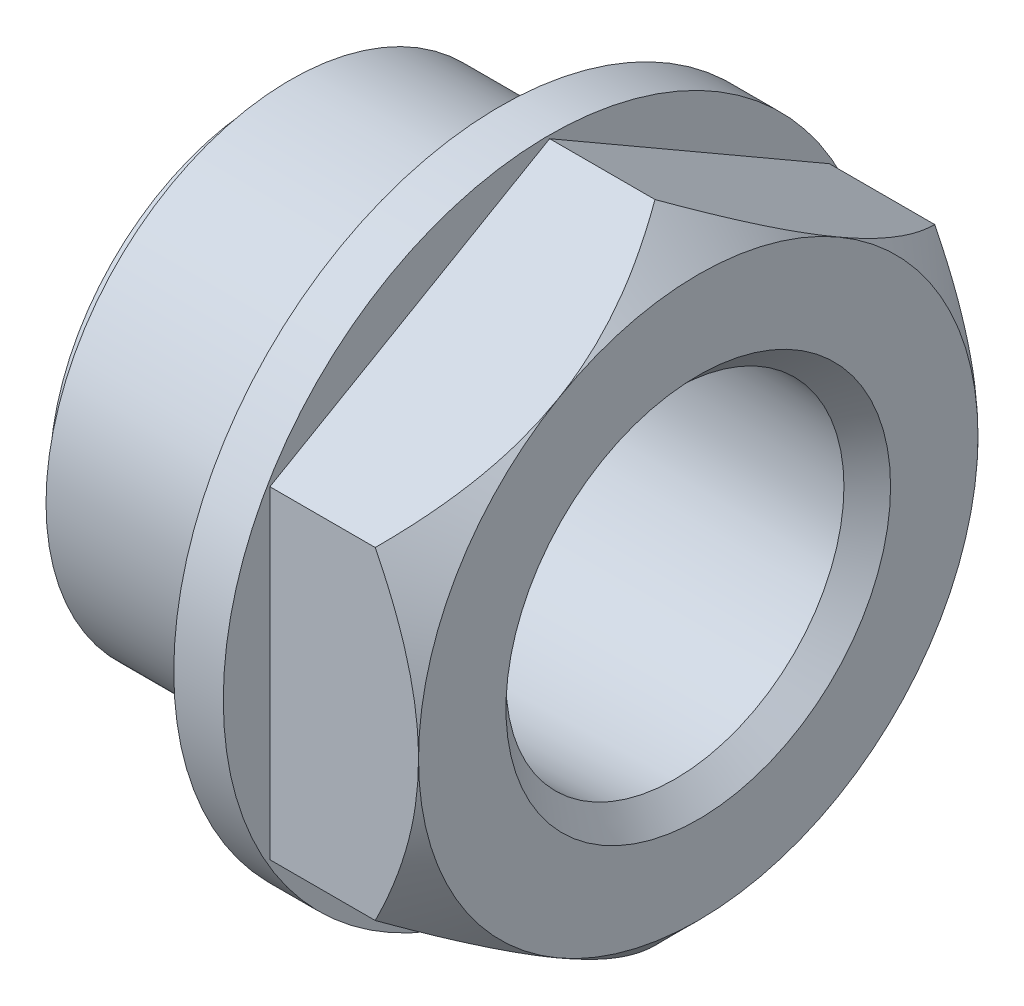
ISO-10303-21;
HEADER;
FILE_DESCRIPTION(('STEP AP214'),'2;1');
FILE_NAME('part.step','',(''),(''),'','','');
FILE_SCHEMA(('AUTOMOTIVE_DESIGN { 1 0 10303 214 1 1 1 1 }'));
ENDSEC;
DATA;
#1=APPLICATION_CONTEXT('core data for automotive mechanical design processes');
#2=APPLICATION_PROTOCOL_DEFINITION('international standard','automotive_design',2000,#1);
#3=PRODUCT_CONTEXT('',#1,'mechanical');
#4=PRODUCT('Part','Part','',(#3));
#5=PRODUCT_RELATED_PRODUCT_CATEGORY('part','',(#4));
#6=PRODUCT_DEFINITION_FORMATION('','',#4);
#7=PRODUCT_DEFINITION_CONTEXT('part definition',#1,'design');
#8=PRODUCT_DEFINITION('design','',#6,#7);
#9=PRODUCT_DEFINITION_SHAPE('','',#8);
#10=(LENGTH_UNIT() NAMED_UNIT(*) SI_UNIT(.MILLI.,.METRE.));
#11=(NAMED_UNIT(*) PLANE_ANGLE_UNIT() SI_UNIT($,.RADIAN.));
#12=(NAMED_UNIT(*) SI_UNIT($,.STERADIAN.) SOLID_ANGLE_UNIT());
#13=UNCERTAINTY_MEASURE_WITH_UNIT(LENGTH_MEASURE(1.E-05),#10,'distance_accuracy_value','');
#14=(GEOMETRIC_REPRESENTATION_CONTEXT(3) GLOBAL_UNCERTAINTY_ASSIGNED_CONTEXT((#13)) GLOBAL_UNIT_ASSIGNED_CONTEXT((#10,
#11,#12)) REPRESENTATION_CONTEXT('',''));
#15=CARTESIAN_POINT('',(0.,0.,0.));
#16=DIRECTION('',(0.,0.,1.));
#17=DIRECTION('',(1.,0.,0.));
#18=AXIS2_PLACEMENT_3D('',#15,#16,#17);
#19=CARTESIAN_POINT('',(10.,13.146,0.));
#20=DIRECTION('',(-1.,0.,0.));
#21=DIRECTION('',(0.,0.,1.));
#22=AXIS2_PLACEMENT_3D('',#19,#20,#21);
#23=PLANE('',#22);
#24=CARTESIAN_POINT('',(10.,0.,0.));
#25=DIRECTION('',(-1.,0.,0.));
#26=DIRECTION('',(0.,0.,1.));
#27=AXIS2_PLACEMENT_3D('',#24,#25,#26);
#28=CIRCLE('',#27,12.292);
#29=CARTESIAN_POINT('',(10.,0.,12.292));
#30=VERTEX_POINT('',#29);
#31=EDGE_CURVE('E366',#30,#30,#28,.T.);
#32=ORIENTED_EDGE('',*,*,#31,.F.);
#33=EDGE_LOOP('',(#32));
#34=FACE_BOUND('',#33,.T.);
#35=CARTESIAN_POINT('',(10.,0.,0.));
#36=DIRECTION('',(-1.,0.,0.));
#37=DIRECTION('',(0.,0.,1.));
#38=AXIS2_PLACEMENT_3D('',#35,#36,#37);
#39=CIRCLE('',#38,14.);
#40=CARTESIAN_POINT('',(10.,0.,14.));
#41=VERTEX_POINT('',#40);
#42=EDGE_CURVE('E19',#41,#41,#39,.F.);
#43=ORIENTED_EDGE('',*,*,#42,.F.);
#44=EDGE_LOOP('',(#43));
#45=FACE_BOUND('',#44,.T.);
#46=ADVANCED_FACE('F16',(#34,#45),#23,.T.);
#47=CARTESIAN_POINT('',(13.25,0.,0.));
#48=DIRECTION('',(-1.,0.,0.));
#49=DIRECTION('',(0.,0.,1.));
#50=AXIS2_PLACEMENT_3D('',#47,#48,#49);
#51=CYLINDRICAL_SURFACE('',#50,14.);
#52=CARTESIAN_POINT('',(12.125,0.,0.));
#53=DIRECTION('',(-1.,0.,0.));
#54=DIRECTION('',(0.,0.,1.));
#55=AXIS2_PLACEMENT_3D('',#52,#53,#54);
#56=CIRCLE('',#55,14.);
#57=CARTESIAN_POINT('',(12.125,0.,14.));
#58=VERTEX_POINT('',#57);
#59=EDGE_CURVE('E364',#58,#58,#56,.F.);
#60=ORIENTED_EDGE('',*,*,#59,.F.);
#61=EDGE_LOOP('',(#60));
#62=FACE_BOUND('',#61,.T.);
#63=ORIENTED_EDGE('',*,*,#42,.T.);
#64=EDGE_LOOP('',(#63));
#65=FACE_BOUND('',#64,.T.);
#66=ADVANCED_FACE('F306',(#62,#65),#51,.T.);
#67=CARTESIAN_POINT('',(9.5,0.,0.));
#68=DIRECTION('',(-1.,0.,0.));
#69=DIRECTION('',(0.,0.,1.));
#70=AXIS2_PLACEMENT_3D('',#67,#68,#69);
#71=CYLINDRICAL_SURFACE('',#70,12.292);
#72=ORIENTED_EDGE('',*,*,#31,.T.);
#73=EDGE_LOOP('',(#72));
#74=FACE_BOUND('',#73,.T.);
#75=CARTESIAN_POINT('',(9.,0.,0.));
#76=DIRECTION('',(-1.,0.,0.));
#77=DIRECTION('',(0.,0.,1.));
#78=AXIS2_PLACEMENT_3D('',#75,#76,#77);
#79=CIRCLE('',#78,12.292);
#80=CARTESIAN_POINT('',(9.,0.,12.292));
#81=VERTEX_POINT('',#80);
#82=EDGE_CURVE('E146',#81,#81,#79,.T.);
#83=ORIENTED_EDGE('',*,*,#82,.F.);
#84=EDGE_LOOP('',(#83));
#85=FACE_BOUND('',#84,.T.);
#86=ADVANCED_FACE('F304',(#74,#85),#71,.T.);
#87=CARTESIAN_POINT('',(12.125,0.,0.));
#88=DIRECTION('',(1.,0.,0.));
#89=DIRECTION('',(0.,0.,-1.));
#90=AXIS2_PLACEMENT_3D('',#87,#88,#89);
#91=PLANE('',#90);
#92=DIRECTION('',(0.,1.,0.));
#93=VECTOR('',#92,1.);
#94=CARTESIAN_POINT('',(12.125,-6.92820323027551,12.));
#95=LINE('',#94,#93);
#96=CARTESIAN_POINT('',(12.125,-6.92820323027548,12.));
#97=VERTEX_POINT('',#96);
#98=CARTESIAN_POINT('',(12.125,6.92820323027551,12.));
#99=VERTEX_POINT('',#98);
#100=EDGE_CURVE('E135',#97,#99,#95,.T.);
#101=ORIENTED_EDGE('',*,*,#100,.T.);
#102=DIRECTION('',(0.,0.5,-0.866025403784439));
#103=VECTOR('',#102,1.);
#104=CARTESIAN_POINT('',(12.125,6.92820323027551,12.));
#105=LINE('',#104,#103);
#106=CARTESIAN_POINT('',(12.125,13.856406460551,0.));
#107=VERTEX_POINT('',#106);
#108=EDGE_CURVE('E102',#99,#107,#105,.T.);
#109=ORIENTED_EDGE('',*,*,#108,.T.);
#110=DIRECTION('',(0.,-0.500000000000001,-0.866025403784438));
#111=VECTOR('',#110,1.);
#112=CARTESIAN_POINT('',(12.125,14.4337567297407,1.));
#113=LINE('',#112,#111);
#114=CARTESIAN_POINT('',(12.125,6.92820323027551,-12.));
#115=VERTEX_POINT('',#114);
#116=EDGE_CURVE('E96',#107,#115,#113,.T.);
#117=ORIENTED_EDGE('',*,*,#116,.T.);
#118=DIRECTION('',(0.,1.,0.));
#119=VECTOR('',#118,1.);
#120=CARTESIAN_POINT('',(12.125,6.9282032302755,-12.));
#121=LINE('',#120,#119);
#122=CARTESIAN_POINT('',(12.125,-6.9282032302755,-12.));
#123=VERTEX_POINT('',#122);
#124=EDGE_CURVE('E101',#115,#123,#121,.F.);
#125=ORIENTED_EDGE('',*,*,#124,.T.);
#126=DIRECTION('',(0.,-0.5,0.866025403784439));
#127=VECTOR('',#126,1.);
#128=CARTESIAN_POINT('',(12.125,-6.9282032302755,-12.));
#129=LINE('',#128,#127);
#130=CARTESIAN_POINT('',(12.125,-13.856406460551,0.));
#131=VERTEX_POINT('',#130);
#132=EDGE_CURVE('E125',#123,#131,#129,.T.);
#133=ORIENTED_EDGE('',*,*,#132,.T.);
#134=DIRECTION('',(0.,0.5,0.866025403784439));
#135=VECTOR('',#134,1.);
#136=CARTESIAN_POINT('',(12.125,-14.4337567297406,-1.));
#137=LINE('',#136,#135);
#138=EDGE_CURVE('E130',#131,#97,#137,.T.);
#139=ORIENTED_EDGE('',*,*,#138,.T.);
#140=EDGE_LOOP('',(#101,#109,#117,#125,#133,#139));
#141=FACE_BOUND('',#140,.T.);
#142=ORIENTED_EDGE('',*,*,#59,.T.);
#143=EDGE_LOOP('',(#142));
#144=FACE_BOUND('',#143,.T.);
#145=ADVANCED_FACE('F98',(#141,#144),#91,.T.);
#146=CARTESIAN_POINT('',(9.,11.386,0.));
#147=DIRECTION('',(-1.,0.,0.));
#148=DIRECTION('',(0.,0.,1.));
#149=AXIS2_PLACEMENT_3D('',#146,#147,#148);
#150=PLANE('',#149);
#151=CARTESIAN_POINT('',(9.,0.,0.));
#152=DIRECTION('',(-1.,0.,0.));
#153=DIRECTION('',(0.,0.,1.));
#154=AXIS2_PLACEMENT_3D('',#151,#152,#153);
#155=CIRCLE('',#154,10.48);
#156=CARTESIAN_POINT('',(9.,0.,10.48));
#157=VERTEX_POINT('',#156);
#158=EDGE_CURVE('E352',#157,#157,#155,.T.);
#159=ORIENTED_EDGE('',*,*,#158,.F.);
#160=EDGE_LOOP('',(#159));
#161=FACE_BOUND('',#160,.T.);
#162=ORIENTED_EDGE('',*,*,#82,.T.);
#163=EDGE_LOOP('',(#162));
#164=FACE_BOUND('',#163,.T.);
#165=ADVANCED_FACE('F296',(#161,#164),#150,.T.);
#166=CARTESIAN_POINT('',(24.875,6.92820323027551,12.));
#167=DIRECTION('',(0.,-0.866025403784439,-0.5));
#168=DIRECTION('',(0.,0.5,-0.866025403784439));
#169=AXIS2_PLACEMENT_3D('',#166,#167,#168);
#170=PLANE('',#169);
#171=ORIENTED_EDGE('',*,*,#108,.F.);
#172=DIRECTION('',(-1.,0.,0.));
#173=VECTOR('',#172,1.);
#174=CARTESIAN_POINT('',(24.875,6.92820323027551,12.));
#175=LINE('',#174,#173);
#176=CARTESIAN_POINT('',(16.6435935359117,6.92820322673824,12.0000000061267));
#177=VERTEX_POINT('',#176);
#178=EDGE_CURVE('E133',#99,#177,#175,.F.);
#179=ORIENTED_EDGE('',*,*,#178,.T.);
#180=CARTESIAN_POINT('',(18.5,10.3923048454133,5.99999999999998));
#181=CARTESIAN_POINT('',(18.5000214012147,10.3001580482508,6.15960293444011));
#182=CARTESIAN_POINT('',(18.4957550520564,10.2080149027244,6.31919954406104));
#183=CARTESIAN_POINT('',(18.4788058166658,10.0239363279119,6.63803298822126));
#184=CARTESIAN_POINT('',(18.4661242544,9.93200086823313,6.79726987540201));
#185=CARTESIAN_POINT('',(18.4325329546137,9.74866992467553,7.11480838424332));
#186=CARTESIAN_POINT('',(18.4116376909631,9.65727377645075,7.27311115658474));
#187=CARTESIAN_POINT('',(18.3619199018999,9.47502603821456,7.58877349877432));
#188=CARTESIAN_POINT('',(18.3330971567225,9.38417446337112,7.74613304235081));
#189=CARTESIAN_POINT('',(18.2362673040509,9.11539646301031,8.2116701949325));
#190=CARTESIAN_POINT('',(18.1573597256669,8.93843123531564,8.51818296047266));
#191=CARTESIAN_POINT('',(17.9736695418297,8.58789265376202,9.12533359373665));
#192=CARTESIAN_POINT('',(17.8688788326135,8.41432038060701,9.42596958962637));
#193=CARTESIAN_POINT('',(17.6773863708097,8.13044417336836,9.91765760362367));
#194=CARTESIAN_POINT('',(17.5969985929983,8.01905764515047,10.1105847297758));
#195=CARTESIAN_POINT('',(17.4278289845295,7.79791723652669,10.4936111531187));
#196=CARTESIAN_POINT('',(17.3390489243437,7.68816301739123,10.6837110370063));
#197=CARTESIAN_POINT('',(17.1530787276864,7.46911823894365,11.0631077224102));
#198=CARTESIAN_POINT('',(17.0558111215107,7.35984420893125,11.2523758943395));
#199=CARTESIAN_POINT('',(16.8545394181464,7.14286473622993,11.6281953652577));
#200=CARTESIAN_POINT('',(16.7505357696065,7.03515918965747,11.8147468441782));
#201=CARTESIAN_POINT('',(16.6435935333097,6.92820322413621,12.0000000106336));
#202=B_SPLINE_CURVE_WITH_KNOTS('',3,(#180,#181,#182,#183,#184,#185,#186,#187,#188,#189,#190,
#191,#192,#193,#194,#195,#196,#197,#198,#199,#200,#201),.UNSPECIFIED.,.F.,.F.,(4,2,2,2,2,2,2,2,
2,2,4),(0.,0.552819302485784,1.10555165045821,1.65731432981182,2.20909230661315,
3.29573306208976,4.38271446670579,5.09304904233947,5.80323409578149,6.52076262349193,
7.23824340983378),.UNSPECIFIED.);
#203=CARTESIAN_POINT('',(18.5,10.3923048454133,5.99999999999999));
#204=VERTEX_POINT('',#203);
#205=EDGE_CURVE('E255',#204,#177,#202,.T.);
#206=ORIENTED_EDGE('',*,*,#205,.F.);
#207=CARTESIAN_POINT('',(16.643593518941,13.8564064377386,-2.17519626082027E-08));
#208=CARTESIAN_POINT('',(16.7634443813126,13.7365345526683,0.207624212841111));
#209=CARTESIAN_POINT('',(16.8796150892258,13.6157176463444,0.416885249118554));
#210=CARTESIAN_POINT('',(17.1034212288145,13.3720429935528,0.838942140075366));
#211=CARTESIAN_POINT('',(17.2110517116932,13.2491841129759,1.0517399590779));
#212=CARTESIAN_POINT('',(17.4171049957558,13.0006364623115,1.48223711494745));
#213=CARTESIAN_POINT('',(17.5154658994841,12.8749347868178,1.6999588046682));
#214=CARTESIAN_POINT('',(17.7007499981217,12.6214559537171,2.13899702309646));
#215=CARTESIAN_POINT('',(17.7876752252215,12.4936791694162,2.36031290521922));
#216=CARTESIAN_POINT('',(17.9462537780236,12.239803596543,2.80003829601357));
#217=CARTESIAN_POINT('',(18.0182750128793,12.1137625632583,3.01834776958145));
#218=CARTESIAN_POINT('',(18.1486623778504,11.8599300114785,3.45799864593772));
#219=CARTESIAN_POINT('',(18.2070300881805,11.7321386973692,3.67933969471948));
#220=CARTESIAN_POINT('',(18.308634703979,11.4754170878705,4.1239945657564));
#221=CARTESIAN_POINT('',(18.3519126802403,11.3464908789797,4.34730130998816));
#222=CARTESIAN_POINT('',(18.4224240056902,11.0875704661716,4.79576462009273));
#223=CARTESIAN_POINT('',(18.4496624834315,10.9575766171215,5.02092057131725));
#224=CARTESIAN_POINT('',(18.4789525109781,10.75506120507,5.37168755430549));
#225=CARTESIAN_POINT('',(18.4868188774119,10.6827399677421,5.49695161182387));
#226=CARTESIAN_POINT('',(18.4973561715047,10.5377162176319,5.74814011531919));
#227=CARTESIAN_POINT('',(18.5000063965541,10.4650133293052,5.87406521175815));
#228=CARTESIAN_POINT('',(18.5,10.3923048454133,5.99999999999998));
#229=B_SPLINE_CURVE_WITH_KNOTS('',3,(#207,#208,#209,#210,#211,#212,#213,#214,#215,#216,#217,
#218,#219,#220,#221,#222,#223,#224,#225,#226,#227,#228),.UNSPECIFIED.,.F.,.F.,(4,2,2,2,2,2,2,2,
2,2,4),(0.,0.804132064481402,1.60872674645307,2.41836120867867,3.22785159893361,
4.01401465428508,4.80008667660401,5.58400217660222,6.36766688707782,6.8021509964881,
7.23835610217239),.UNSPECIFIED.);
#230=CARTESIAN_POINT('',(16.6435935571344,13.8564064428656,-3.06321939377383E-08));
#231=VERTEX_POINT('',#230);
#232=EDGE_CURVE('E282',#231,#204,#229,.T.);
#233=ORIENTED_EDGE('',*,*,#232,.F.);
#234=DIRECTION('',(1.,0.,0.));
#235=VECTOR('',#234,1.);
#236=CARTESIAN_POINT('',(24.875,13.856406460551,0.));
#237=LINE('',#236,#235);
#238=EDGE_CURVE('E106',#231,#107,#237,.F.);
#239=ORIENTED_EDGE('',*,*,#238,.T.);
#240=EDGE_LOOP('',(#171,#179,#206,#233,#239));
#241=FACE_BOUND('',#240,.T.);
#242=ADVANCED_FACE('F292',(#241),#170,.F.);
#243=CARTESIAN_POINT('',(24.875,-6.92820323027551,12.));
#244=DIRECTION('',(0.,0.,-1.));
#245=DIRECTION('',(-1.,0.,0.));
#246=AXIS2_PLACEMENT_3D('',#243,#244,#245);
#247=PLANE('',#246);
#248=CARTESIAN_POINT('',(16.6435935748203,6.9282031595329,12.));
#249=CARTESIAN_POINT('',(16.7634444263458,6.68845935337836,12.));
#250=CARTESIAN_POINT('',(16.8796151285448,6.44682552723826,12.));
#251=CARTESIAN_POINT('',(17.1034212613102,5.95947621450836,12.));
#252=CARTESIAN_POINT('',(17.2110517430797,5.7137584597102,12.));
#253=CARTESIAN_POINT('',(17.4171050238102,5.21666316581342,12.));
#254=CARTESIAN_POINT('',(17.5154659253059,4.96525981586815,12.));
#255=CARTESIAN_POINT('',(17.7007500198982,4.45830215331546,12.));
#256=CARTESIAN_POINT('',(17.7876752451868,4.20274858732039,12.));
#257=CARTESIAN_POINT('',(17.9462537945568,3.69499744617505,12.));
#258=CARTESIAN_POINT('',(18.0182750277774,3.44291538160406,12.));
#259=CARTESIAN_POINT('',(18.1486623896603,2.93525028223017,12.));
#260=CARTESIAN_POINT('',(18.207030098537,2.67966765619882,12.));
#261=CARTESIAN_POINT('',(18.3086347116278,2.16622444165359,12.));
#262=CARTESIAN_POINT('',(18.3519126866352,1.90837202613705,12.));
#263=CARTESIAN_POINT('',(18.4224240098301,1.39053120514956,12.));
#264=CARTESIAN_POINT('',(18.449662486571,1.13054350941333,12.));
#265=CARTESIAN_POINT('',(18.4789525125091,0.725512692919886,12.));
#266=CARTESIAN_POINT('',(18.4868188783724,0.580870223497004,12.));
#267=CARTESIAN_POINT('',(18.4973561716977,0.290822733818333,12.));
#268=CARTESIAN_POINT('',(18.5000063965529,0.145416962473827,12.));
#269=CARTESIAN_POINT('',(18.5,0.,12.));
#270=B_SPLINE_CURVE_WITH_KNOTS('',3,(#248,#249,#250,#251,#252,#253,#254,#255,#256,#257,#258,
#259,#260,#261,#262,#263,#264,#265,#266,#267,#268,#269),.UNSPECIFIED.,.F.,.F.,(4,2,2,2,2,2,2,2,
2,2,4),(0.,0.804132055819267,1.60872672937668,2.41836118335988,3.22785156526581,
4.01401461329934,4.80008662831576,5.58400212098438,6.36766682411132,6.80215091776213,
7.23835600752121),.UNSPECIFIED.);
#271=CARTESIAN_POINT('',(18.5,0.,12.));
#272=VERTEX_POINT('',#271);
#273=EDGE_CURVE('E277',#177,#272,#270,.T.);
#274=ORIENTED_EDGE('',*,*,#273,.F.);
#275=ORIENTED_EDGE('',*,*,#178,.F.);
#276=ORIENTED_EDGE('',*,*,#100,.F.);
#277=DIRECTION('',(1.,0.,0.));
#278=VECTOR('',#277,1.);
#279=CARTESIAN_POINT('',(24.875,-6.92820323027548,12.));
#280=LINE('',#279,#278);
#281=CARTESIAN_POINT('',(16.6435935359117,-6.92820323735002,12.));
#282=VERTEX_POINT('',#281);
#283=EDGE_CURVE('E128',#97,#282,#280,.T.);
#284=ORIENTED_EDGE('',*,*,#283,.T.);
#285=CARTESIAN_POINT('',(18.5,0.,12.));
#286=CARTESIAN_POINT('',(18.5000214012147,-0.184293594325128,12.));
#287=CARTESIAN_POINT('',(18.4957550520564,-0.368579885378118,12.));
#288=CARTESIAN_POINT('',(18.4788058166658,-0.736737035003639,12.));
#289=CARTESIAN_POINT('',(18.4661242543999,-0.920607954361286,12.));
#290=CARTESIAN_POINT('',(18.4325329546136,-1.28726984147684,12.));
#291=CARTESIAN_POINT('',(18.4116376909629,-1.47006213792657,12.));
#292=CARTESIAN_POINT('',(18.3619199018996,-1.83455761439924,12.));
#293=CARTESIAN_POINT('',(18.3330971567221,-2.01626076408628,12.));
#294=CARTESIAN_POINT('',(18.2362673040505,-2.55381676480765,12.));
#295=CARTESIAN_POINT('',(18.1573597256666,-2.9077472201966,12.));
#296=CARTESIAN_POINT('',(17.9736695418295,-3.60882438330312,12.));
#297=CARTESIAN_POINT('',(17.8688788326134,-3.95596892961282,12.));
#298=CARTESIAN_POINT('',(17.6773863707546,-4.52372134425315,12.));
#299=CARTESIAN_POINT('',(17.5969985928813,-4.74649440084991,12.));
#300=CARTESIAN_POINT('',(17.427828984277,-5.18877521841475,12.));
#301=CARTESIAN_POINT('',(17.3390489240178,-5.40828365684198,12.));
#302=CARTESIAN_POINT('',(17.1530787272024,-5.84637321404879,12.));
#303=CARTESIAN_POINT('',(17.0558111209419,-6.06492127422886,12.));
#304=CARTESIAN_POINT('',(16.8545394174,-6.49888021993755,12.));
#305=CARTESIAN_POINT('',(16.7505357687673,-6.71429131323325,12.));
#306=CARTESIAN_POINT('',(16.6435935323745,-6.92820324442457,12.));
#307=B_SPLINE_CURVE_WITH_KNOTS('',3,(#285,#286,#287,#288,#289,#290,#291,#292,#293,#294,#295,
#296,#297,#298,#299,#300,#301,#302,#303,#304,#305,#306),.UNSPECIFIED.,.F.,.F.,(4,2,2,2,2,2,2,2,
2,2,4),(0.,0.552819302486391,1.10555165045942,1.65731432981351,2.20909230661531,
3.29573306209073,4.3827144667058,5.09304904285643,5.80323409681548,6.52076262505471,
7.23824341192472),.UNSPECIFIED.);
#308=EDGE_CURVE('E254',#272,#282,#307,.T.);
#309=ORIENTED_EDGE('',*,*,#308,.F.);
#310=EDGE_LOOP('',(#274,#275,#276,#284,#309));
#311=FACE_BOUND('',#310,.T.);
#312=ADVANCED_FACE('F242',(#311),#247,.F.);
#313=CARTESIAN_POINT('',(24.875,-14.4337567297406,-1.));
#314=DIRECTION('',(0.,0.866025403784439,-0.5));
#315=DIRECTION('',(0.,0.5,0.866025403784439));
#316=AXIS2_PLACEMENT_3D('',#313,#314,#315);
#317=PLANE('',#316);
#318=CARTESIAN_POINT('',(18.5,-10.3923048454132,5.99999999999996));
#319=CARTESIAN_POINT('',(18.5000214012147,-10.4844516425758,5.84039706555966));
#320=CARTESIAN_POINT('',(18.4957550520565,-10.5765947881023,5.68080045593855));
#321=CARTESIAN_POINT('',(18.4788058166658,-10.7606733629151,5.36196701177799));
#322=CARTESIAN_POINT('',(18.4661242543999,-10.8526088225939,5.20273012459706));
#323=CARTESIAN_POINT('',(18.4325329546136,-11.0359397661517,4.88519161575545));
#324=CARTESIAN_POINT('',(18.411637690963,-11.1273359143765,4.72688884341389));
#325=CARTESIAN_POINT('',(18.3619199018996,-11.3095836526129,4.41122650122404));
#326=CARTESIAN_POINT('',(18.3330971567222,-11.4004352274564,4.25386695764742));
#327=CARTESIAN_POINT('',(18.2362673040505,-11.6692132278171,3.78832980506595));
#328=CARTESIAN_POINT('',(18.1573597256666,-11.8461784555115,3.48181703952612));
#329=CARTESIAN_POINT('',(17.9736695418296,-12.1967170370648,2.87466640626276));
#330=CARTESIAN_POINT('',(17.8688788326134,-12.3702893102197,2.57403041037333));
#331=CARTESIAN_POINT('',(17.6773863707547,-12.6541655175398,2.08234239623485));
#332=CARTESIAN_POINT('',(17.5969985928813,-12.7655520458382,1.88941526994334));
#333=CARTESIAN_POINT('',(17.4278289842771,-12.9866924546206,1.50638884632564));
#334=CARTESIAN_POINT('',(17.3390489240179,-13.0964466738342,1.31628896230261));
#335=CARTESIAN_POINT('',(17.1530787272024,-13.3154914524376,0.936892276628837));
#336=CARTESIAN_POINT('',(17.0558111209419,-13.4247654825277,0.747624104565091));
#337=CARTESIAN_POINT('',(16.8545394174,-13.641744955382,0.371804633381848));
#338=CARTESIAN_POINT('',(16.7505357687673,-13.7494505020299,0.185253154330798));
#339=CARTESIAN_POINT('',(16.6435935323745,-13.8564064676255,-1.22534716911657E-08));
#340=B_SPLINE_CURVE_WITH_KNOTS('',3,(#318,#319,#320,#321,#322,#323,#324,#325,#326,#327,#328,
#329,#330,#331,#332,#333,#334,#335,#336,#337,#338,#339),.UNSPECIFIED.,.F.,.F.,(4,2,2,2,2,2,2,2,
2,2,4),(0.,0.55281930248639,1.10555165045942,1.65731432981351,2.20909230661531,3.29573306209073,
4.38271446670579,5.09304904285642,5.80323409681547,6.52076262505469,7.23824341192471),.UNSPECIFIED.);
#341=CARTESIAN_POINT('',(18.5,-10.3923048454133,5.99999999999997));
#342=VERTEX_POINT('',#341);
#343=CARTESIAN_POINT('',(16.6435935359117,-13.8564064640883,-6.12673527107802E-09));
#344=VERTEX_POINT('',#343);
#345=EDGE_CURVE('E225',#342,#344,#340,.T.);
#346=ORIENTED_EDGE('',*,*,#345,.F.);
#347=CARTESIAN_POINT('',(16.6435935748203,-6.92820326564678,11.9999999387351));
#348=CARTESIAN_POINT('',(16.7634444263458,-7.04807516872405,11.7923757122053));
#349=CARTESIAN_POINT('',(16.8796151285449,-7.1688920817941,11.5831146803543));
#350=CARTESIAN_POINT('',(17.1034212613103,-7.41256673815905,11.1610577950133));
#351=CARTESIAN_POINT('',(17.2110517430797,-7.53542561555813,10.9482599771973));
#352=CARTESIAN_POINT('',(17.4171050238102,-7.78397326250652,10.517762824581));
#353=CARTESIAN_POINT('',(17.5154659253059,-7.90967493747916,10.3000411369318));
#354=CARTESIAN_POINT('',(17.7007500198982,-8.1631537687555,9.86100292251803));
#355=CARTESIAN_POINT('',(17.7876752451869,-8.29093055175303,9.63968704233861));
#356=CARTESIAN_POINT('',(17.9462537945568,-8.54480612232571,9.1999616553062));
#357=CARTESIAN_POINT('',(18.0182750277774,-8.6708471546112,8.9816521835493));
#358=CARTESIAN_POINT('',(18.1486623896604,-8.92467970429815,8.54200131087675));
#359=CARTESIAN_POINT('',(18.2070300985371,-9.05247101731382,8.32066026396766));
#360=CARTESIAN_POINT('',(18.3086347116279,-9.30919262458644,7.87600539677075));
#361=CARTESIAN_POINT('',(18.3519126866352,-9.43811883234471,7.65269865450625));
#362=CARTESIAN_POINT('',(18.4224240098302,-9.69703924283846,7.20423534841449));
#363=CARTESIAN_POINT('',(18.449662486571,-9.82703309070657,6.97907939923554));
#364=CARTESIAN_POINT('',(18.4789525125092,-10.0295484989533,6.62831242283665));
#365=CARTESIAN_POINT('',(18.4868188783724,-10.1018697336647,6.50304836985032));
#366=CARTESIAN_POINT('',(18.4973561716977,-10.2468934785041,6.25185987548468));
#367=CARTESIAN_POINT('',(18.500006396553,-10.3195963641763,6.12593478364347));
#368=CARTESIAN_POINT('',(18.5,-10.3923048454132,5.99999999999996));
#369=B_SPLINE_CURVE_WITH_KNOTS('',3,(#347,#348,#349,#350,#351,#352,#353,#354,#355,#356,#357,
#358,#359,#360,#361,#362,#363,#364,#365,#366,#367,#368),.UNSPECIFIED.,.F.,.F.,(4,2,2,2,2,2,2,2,
2,2,4),(0.,0.804132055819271,1.60872672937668,2.41836118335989,3.22785156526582,
4.01401461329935,4.80008662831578,5.58400212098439,6.36766682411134,6.80215091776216,
7.23835600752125),.UNSPECIFIED.);
#370=EDGE_CURVE('E249',#282,#342,#369,.T.);
#371=ORIENTED_EDGE('',*,*,#370,.F.);
#372=ORIENTED_EDGE('',*,*,#283,.F.);
#373=ORIENTED_EDGE('',*,*,#138,.F.);
#374=DIRECTION('',(1.,0.,0.));
#375=VECTOR('',#374,1.);
#376=CARTESIAN_POINT('',(24.875,-13.856406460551,0.));
#377=LINE('',#376,#375);
#378=EDGE_CURVE('E121',#131,#344,#377,.T.);
#379=ORIENTED_EDGE('',*,*,#378,.T.);
#380=EDGE_LOOP('',(#346,#371,#372,#373,#379));
#381=FACE_BOUND('',#380,.T.);
#382=ADVANCED_FACE('F237',(#381),#317,.F.);
#383=CARTESIAN_POINT('',(24.875,-6.9282032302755,-12.));
#384=DIRECTION('',(0.,0.866025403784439,0.5));
#385=DIRECTION('',(0.,-0.5,0.866025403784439));
#386=AXIS2_PLACEMENT_3D('',#383,#384,#385);
#387=PLANE('',#386);
#388=CARTESIAN_POINT('',(16.6435935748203,-13.8564064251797,-6.12648886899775E-08));
#389=CARTESIAN_POINT('',(16.7634444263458,-13.7365345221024,-0.207624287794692));
#390=CARTESIAN_POINT('',(16.8796151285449,-13.6157176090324,-0.416885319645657));
#391=CARTESIAN_POINT('',(17.1034212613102,-13.3720429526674,-0.838942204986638));
#392=CARTESIAN_POINT('',(17.2110517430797,-13.2491840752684,-1.05174002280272));
#393=CARTESIAN_POINT('',(17.4171050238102,-13.00063642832,-1.48223717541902));
#394=CARTESIAN_POINT('',(17.5154659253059,-12.8749347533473,-1.69995886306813));
#395=CARTESIAN_POINT('',(17.7007500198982,-12.621455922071,-2.13899707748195));
#396=CARTESIAN_POINT('',(17.7876752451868,-12.4936791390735,-2.36031295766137));
#397=CARTESIAN_POINT('',(17.9462537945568,-12.2398035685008,-2.80003834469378));
#398=CARTESIAN_POINT('',(18.0182750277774,-12.1137625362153,-3.01834781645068));
#399=CARTESIAN_POINT('',(18.1486623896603,-11.8599299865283,-3.45799868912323));
#400=CARTESIAN_POINT('',(18.207030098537,-11.7321386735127,-3.67933973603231));
#401=CARTESIAN_POINT('',(18.3086347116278,-11.4754170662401,-4.12399460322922));
#402=CARTESIAN_POINT('',(18.3519126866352,-11.3464908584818,-4.34730134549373));
#403=CARTESIAN_POINT('',(18.4224240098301,-11.087570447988,-4.79576465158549));
#404=CARTESIAN_POINT('',(18.449662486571,-10.9575766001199,-5.02092060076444));
#405=CARTESIAN_POINT('',(18.4789525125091,-10.7550611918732,-5.37168757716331));
#406=CARTESIAN_POINT('',(18.4868188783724,-10.6827399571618,-5.49695163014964));
#407=CARTESIAN_POINT('',(18.4973561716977,-10.5377162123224,-5.74814012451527));
#408=CARTESIAN_POINT('',(18.5000063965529,-10.4650133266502,-5.87406521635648));
#409=CARTESIAN_POINT('',(18.5,-10.3923048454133,-5.99999999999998));
#410=B_SPLINE_CURVE_WITH_KNOTS('',3,(#388,#389,#390,#391,#392,#393,#394,#395,#396,#397,#398,
#399,#400,#401,#402,#403,#404,#405,#406,#407,#408,#409),.UNSPECIFIED.,.F.,.F.,(4,2,2,2,2,2,2,2,
2,2,4),(0.,0.80413205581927,1.60872672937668,2.41836118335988,3.22785156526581,4.01401461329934,
4.80008662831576,5.58400212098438,6.36766682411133,6.80215091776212,7.23835600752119),.UNSPECIFIED.);
#411=CARTESIAN_POINT('',(18.5,-10.3923048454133,-5.99999999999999));
#412=VERTEX_POINT('',#411);
#413=EDGE_CURVE('E232',#344,#412,#410,.T.);
#414=ORIENTED_EDGE('',*,*,#413,.F.);
#415=ORIENTED_EDGE('',*,*,#378,.F.);
#416=ORIENTED_EDGE('',*,*,#132,.F.);
#417=DIRECTION('',(1.,0.,0.));
#418=VECTOR('',#417,1.);
#419=CARTESIAN_POINT('',(24.875,-6.9282032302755,-12.));
#420=LINE('',#419,#418);
#421=CARTESIAN_POINT('',(16.6435935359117,-6.92820322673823,-12.0000000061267));
#422=VERTEX_POINT('',#421);
#423=EDGE_CURVE('E110',#123,#422,#420,.T.);
#424=ORIENTED_EDGE('',*,*,#423,.T.);
#425=CARTESIAN_POINT('',(18.5,-10.3923048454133,-5.99999999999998));
#426=CARTESIAN_POINT('',(18.5000214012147,-10.3001580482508,-6.15960293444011));
#427=CARTESIAN_POINT('',(18.4957550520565,-10.2080149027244,-6.31919954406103));
#428=CARTESIAN_POINT('',(18.4788058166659,-10.0239363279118,-6.63803298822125));
#429=CARTESIAN_POINT('',(18.4661242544,-9.93200086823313,-6.797269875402));
#430=CARTESIAN_POINT('',(18.4325329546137,-9.74866992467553,-7.11480838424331));
#431=CARTESIAN_POINT('',(18.4116376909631,-9.65727377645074,-7.27311115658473));
#432=CARTESIAN_POINT('',(18.3619199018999,-9.47502603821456,-7.58877349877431));
#433=CARTESIAN_POINT('',(18.3330971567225,-9.38417446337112,-7.7461330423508));
#434=CARTESIAN_POINT('',(18.2362673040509,-9.11539646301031,-8.21167019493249));
#435=CARTESIAN_POINT('',(18.1573597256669,-8.93843123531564,-8.51818296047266));
#436=CARTESIAN_POINT('',(17.9736695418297,-8.58789265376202,-9.12533359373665));
#437=CARTESIAN_POINT('',(17.8688788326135,-8.414320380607,-9.42596958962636));
#438=CARTESIAN_POINT('',(17.6773863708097,-8.13044417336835,-9.91765760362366));
#439=CARTESIAN_POINT('',(17.5969985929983,-8.01905764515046,-10.1105847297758));
#440=CARTESIAN_POINT('',(17.4278289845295,-7.79791723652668,-10.4936111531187));
#441=CARTESIAN_POINT('',(17.3390489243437,-7.68816301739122,-10.6837110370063));
#442=CARTESIAN_POINT('',(17.1530787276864,-7.46911823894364,-11.0631077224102));
#443=CARTESIAN_POINT('',(17.0558111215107,-7.35984420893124,-11.2523758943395));
#444=CARTESIAN_POINT('',(16.8545394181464,-7.14286473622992,-11.6281953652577));
#445=CARTESIAN_POINT('',(16.7505357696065,-7.03515918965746,-11.8147468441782));
#446=CARTESIAN_POINT('',(16.6435935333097,-6.9282032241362,-12.0000000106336));
#447=B_SPLINE_CURVE_WITH_KNOTS('',3,(#425,#426,#427,#428,#429,#430,#431,#432,#433,#434,#435,
#436,#437,#438,#439,#440,#441,#442,#443,#444,#445,#446),.UNSPECIFIED.,.F.,.F.,(4,2,2,2,2,2,2,2,
2,2,4),(0.,0.552819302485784,1.10555165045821,1.65731432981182,2.20909230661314,
3.29573306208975,4.38271446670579,5.09304904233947,5.80323409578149,6.52076262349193,
7.23824340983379),.UNSPECIFIED.);
#448=EDGE_CURVE('E215',#412,#422,#447,.T.);
#449=ORIENTED_EDGE('',*,*,#448,.F.);
#450=EDGE_LOOP('',(#414,#415,#416,#424,#449));
#451=FACE_BOUND('',#450,.T.);
#452=ADVANCED_FACE('F241',(#451),#387,.F.);
#453=CARTESIAN_POINT('',(24.875,14.4337567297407,1.));
#454=DIRECTION('',(0.,-0.866025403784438,0.500000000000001));
#455=DIRECTION('',(0.,-0.500000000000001,-0.866025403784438));
#456=AXIS2_PLACEMENT_3D('',#453,#454,#455);
#457=PLANE('',#456);
#458=DIRECTION('',(1.,0.,0.));
#459=VECTOR('',#458,1.);
#460=CARTESIAN_POINT('',(24.875,6.9282032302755,-12.));
#461=LINE('',#460,#459);
#462=CARTESIAN_POINT('',(16.6435935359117,6.92820323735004,-12.));
#463=VERTEX_POINT('',#462);
#464=EDGE_CURVE('E73',#463,#115,#461,.F.);
#465=ORIENTED_EDGE('',*,*,#464,.T.);
#466=ORIENTED_EDGE('',*,*,#116,.F.);
#467=ORIENTED_EDGE('',*,*,#238,.F.);
#468=CARTESIAN_POINT('',(18.5,10.3923048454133,-6.00000000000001));
#469=CARTESIAN_POINT('',(18.5000214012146,10.4844516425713,-5.84039706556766));
#470=CARTESIAN_POINT('',(18.4957550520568,10.5765947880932,-5.68080045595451));
#471=CARTESIAN_POINT('',(18.4788058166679,10.7606733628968,-5.36196701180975));
#472=CARTESIAN_POINT('',(18.4661242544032,10.8526088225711,-5.2027301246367));
#473=CARTESIAN_POINT('',(18.43253295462,11.0359397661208,-4.88519161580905));
#474=CARTESIAN_POINT('',(18.4116376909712,11.1273359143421,-4.7268888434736));
#475=CARTESIAN_POINT('',(18.361919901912,11.3095836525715,-4.41122650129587));
#476=CARTESIAN_POINT('',(18.3330971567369,11.4004352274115,-4.25386695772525));
#477=CARTESIAN_POINT('',(18.2362673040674,11.6692132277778,-3.78832980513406));
#478=CARTESIAN_POINT('',(18.1573597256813,11.8461784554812,-3.48181703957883));
#479=CARTESIAN_POINT('',(17.9736695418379,12.1967170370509,-2.87466640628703));
#480=CARTESIAN_POINT('',(17.8688788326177,12.3702893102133,-2.57403041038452));
#481=CARTESIAN_POINT('',(17.6773863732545,12.6541655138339,-2.0823424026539));
#482=CARTESIAN_POINT('',(17.5969985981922,12.7655520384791,-1.88941528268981));
#483=CARTESIAN_POINT('',(17.4278289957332,12.9866924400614,-1.50638887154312));
#484=CARTESIAN_POINT('',(17.3390489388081,13.096446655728,-1.3162889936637));
#485=CARTESIAN_POINT('',(17.1530787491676,13.3154914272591,-0.936892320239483));
#486=CARTESIAN_POINT('',(17.0558111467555,13.4247654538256,-0.747624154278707));
#487=CARTESIAN_POINT('',(16.854539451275,13.6417449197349,-0.371804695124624));
#488=CARTESIAN_POINT('',(16.7505358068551,13.7494504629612,-0.185253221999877));
#489=CARTESIAN_POINT('',(16.6435935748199,13.8564064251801,-6.12643476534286E-08));
#490=B_SPLINE_CURVE_WITH_KNOTS('',3,(#468,#469,#470,#471,#472,#473,#474,#475,#476,#477,#478,
#479,#480,#481,#482,#483,#484,#485,#486,#487,#488,#489),.UNSPECIFIED.,.F.,.F.,(4,2,2,2,2,2,2,2,
2,2,4),(0.,0.552819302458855,1.10555165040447,1.65731432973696,2.20909230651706,
3.29573306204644,4.38271446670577,5.09304901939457,5.80323404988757,6.52076255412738,
7.23824331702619),.UNSPECIFIED.);
#491=CARTESIAN_POINT('',(18.5,10.3923048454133,-6.00000000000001));
#492=VERTEX_POINT('',#491);
#493=EDGE_CURVE('E287',#492,#231,#490,.T.);
#494=ORIENTED_EDGE('',*,*,#493,.F.);
#495=CARTESIAN_POINT('',(16.6435935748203,6.92820326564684,-11.9999999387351));
#496=CARTESIAN_POINT('',(16.7634444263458,7.04807516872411,-11.7923757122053));
#497=CARTESIAN_POINT('',(16.8796151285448,7.16889208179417,-11.5831146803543));
#498=CARTESIAN_POINT('',(17.1034212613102,7.41256673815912,-11.1610577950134));
#499=CARTESIAN_POINT('',(17.2110517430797,7.5354256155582,-10.9482599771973));
#500=CARTESIAN_POINT('',(17.4171050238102,7.78397326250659,-10.517762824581));
#501=CARTESIAN_POINT('',(17.5154659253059,7.90967493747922,-10.3000411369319));
#502=CARTESIAN_POINT('',(17.7007500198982,8.16315376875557,-9.86100292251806));
#503=CARTESIAN_POINT('',(17.7876752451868,8.2909305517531,-9.63968704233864));
#504=CARTESIAN_POINT('',(17.9462537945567,8.54480612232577,-9.19996165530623));
#505=CARTESIAN_POINT('',(18.0182750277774,8.67084715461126,-8.98165218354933));
#506=CARTESIAN_POINT('',(18.1486623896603,8.92467970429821,-8.54200131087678));
#507=CARTESIAN_POINT('',(18.207030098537,9.05247101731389,-8.3206602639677));
#508=CARTESIAN_POINT('',(18.3086347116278,9.3091926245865,-7.87600539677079));
#509=CARTESIAN_POINT('',(18.3519126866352,9.43811883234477,-7.65269865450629));
#510=CARTESIAN_POINT('',(18.4224240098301,9.69703924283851,-7.20423534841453));
#511=CARTESIAN_POINT('',(18.4496624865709,9.82703309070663,-6.97907939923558));
#512=CARTESIAN_POINT('',(18.4789525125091,10.0295484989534,-6.6283124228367));
#513=CARTESIAN_POINT('',(18.4868188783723,10.1018697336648,-6.50304836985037));
#514=CARTESIAN_POINT('',(18.4973561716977,10.2468934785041,-6.25185987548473));
#515=CARTESIAN_POINT('',(18.5000063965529,10.3195963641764,-6.12593478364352));
#516=CARTESIAN_POINT('',(18.5,10.3923048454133,-6.00000000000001));
#517=B_SPLINE_CURVE_WITH_KNOTS('',3,(#495,#496,#497,#498,#499,#500,#501,#502,#503,#504,#505,
#506,#507,#508,#509,#510,#511,#512,#513,#514,#515,#516),.UNSPECIFIED.,.F.,.F.,(4,2,2,2,2,2,2,2,
2,2,4),(0.,0.804132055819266,1.60872672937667,2.41836118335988,3.22785156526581,
4.01401461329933,4.80008662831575,5.58400212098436,6.36766682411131,6.80215091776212,
7.23835600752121),.UNSPECIFIED.);
#518=EDGE_CURVE('E66',#463,#492,#517,.T.);
#519=ORIENTED_EDGE('',*,*,#518,.F.);
#520=EDGE_LOOP('',(#465,#466,#467,#494,#519));
#521=FACE_BOUND('',#520,.T.);
#522=ADVANCED_FACE('F112',(#521),#457,.F.);
#523=CARTESIAN_POINT('',(24.875,6.9282032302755,-12.));
#524=DIRECTION('',(0.,0.,1.));
#525=DIRECTION('',(1.,0.,0.));
#526=AXIS2_PLACEMENT_3D('',#523,#524,#525);
#527=PLANE('',#526);
#528=CARTESIAN_POINT('',(16.6435935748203,-6.92820315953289,-12.));
#529=CARTESIAN_POINT('',(16.7634444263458,-6.68845935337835,-12.));
#530=CARTESIAN_POINT('',(16.8796151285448,-6.44682552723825,-12.));
#531=CARTESIAN_POINT('',(17.1034212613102,-5.95947621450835,-12.));
#532=CARTESIAN_POINT('',(17.2110517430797,-5.71375845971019,-12.));
#533=CARTESIAN_POINT('',(17.4171050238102,-5.21666316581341,-12.));
#534=CARTESIAN_POINT('',(17.5154659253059,-4.96525981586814,-12.));
#535=CARTESIAN_POINT('',(17.7007500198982,-4.45830215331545,-12.));
#536=CARTESIAN_POINT('',(17.7876752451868,-4.20274858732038,-12.));
#537=CARTESIAN_POINT('',(17.9462537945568,-3.69499744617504,-12.));
#538=CARTESIAN_POINT('',(18.0182750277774,-3.44291538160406,-12.));
#539=CARTESIAN_POINT('',(18.1486623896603,-2.93525028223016,-12.));
#540=CARTESIAN_POINT('',(18.207030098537,-2.67966765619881,-12.));
#541=CARTESIAN_POINT('',(18.3086347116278,-2.16622444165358,-12.));
#542=CARTESIAN_POINT('',(18.3519126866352,-1.90837202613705,-12.));
#543=CARTESIAN_POINT('',(18.4224240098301,-1.39053120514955,-12.));
#544=CARTESIAN_POINT('',(18.449662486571,-1.13054350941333,-12.));
#545=CARTESIAN_POINT('',(18.4789525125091,-0.725512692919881,-12.));
#546=CARTESIAN_POINT('',(18.4868188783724,-0.580870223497,-12.));
#547=CARTESIAN_POINT('',(18.4973561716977,-0.290822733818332,-12.));
#548=CARTESIAN_POINT('',(18.5000063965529,-0.145416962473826,-12.));
#549=CARTESIAN_POINT('',(18.5,0.,-12.));
#550=B_SPLINE_CURVE_WITH_KNOTS('',3,(#528,#529,#530,#531,#532,#533,#534,#535,#536,#537,#538,
#539,#540,#541,#542,#543,#544,#545,#546,#547,#548,#549),.UNSPECIFIED.,.F.,.F.,(4,2,2,2,2,2,2,2,
2,2,4),(0.,0.804132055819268,1.60872672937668,2.41836118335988,3.22785156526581,
4.01401461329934,4.80008662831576,5.58400212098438,6.36766682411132,6.80215091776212,
7.2383560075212),.UNSPECIFIED.);
#551=CARTESIAN_POINT('',(18.5,0.,-12.));
#552=VERTEX_POINT('',#551);
#553=EDGE_CURVE('E34',#422,#552,#550,.T.);
#554=ORIENTED_EDGE('',*,*,#553,.F.);
#555=ORIENTED_EDGE('',*,*,#423,.F.);
#556=ORIENTED_EDGE('',*,*,#124,.F.);
#557=ORIENTED_EDGE('',*,*,#464,.F.);
#558=CARTESIAN_POINT('',(18.5,0.,-12.));
#559=CARTESIAN_POINT('',(18.5000214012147,0.184293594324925,-12.));
#560=CARTESIAN_POINT('',(18.4957550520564,0.368579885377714,-12.));
#561=CARTESIAN_POINT('',(18.4788058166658,0.736737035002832,-12.));
#562=CARTESIAN_POINT('',(18.4661242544,0.920607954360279,-12.));
#563=CARTESIAN_POINT('',(18.4325329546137,1.28726984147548,-12.));
#564=CARTESIAN_POINT('',(18.4116376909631,1.47006213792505,-12.));
#565=CARTESIAN_POINT('',(18.3619199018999,1.83455761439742,-12.));
#566=CARTESIAN_POINT('',(18.3330971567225,2.0162607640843,-12.));
#567=CARTESIAN_POINT('',(18.2362673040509,2.55381676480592,-12.));
#568=CARTESIAN_POINT('',(18.1573597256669,2.90774722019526,-12.));
#569=CARTESIAN_POINT('',(17.9736695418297,3.6088243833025,-12.));
#570=CARTESIAN_POINT('',(17.8688788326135,3.95596892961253,-12.));
#571=CARTESIAN_POINT('',(17.6773863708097,4.52372134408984,-12.));
#572=CARTESIAN_POINT('',(17.5969985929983,4.74649440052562,-12.));
#573=CARTESIAN_POINT('',(17.4278289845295,5.18877521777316,-12.));
#574=CARTESIAN_POINT('',(17.3390489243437,5.40828365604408,-12.));
#575=CARTESIAN_POINT('',(17.1530787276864,5.84637321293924,-12.));
#576=CARTESIAN_POINT('',(17.0558111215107,6.06492127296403,-12.));
#577=CARTESIAN_POINT('',(16.8545394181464,6.49888021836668,-12.));
#578=CARTESIAN_POINT('',(16.7505357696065,6.71429131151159,-12.));
#579=CARTESIAN_POINT('',(16.6435935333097,6.9282032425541,-12.));
#580=B_SPLINE_CURVE_WITH_KNOTS('',3,(#558,#559,#560,#561,#562,#563,#564,#565,#566,#567,#568,
#569,#570,#571,#572,#573,#574,#575,#576,#577,#578,#579),.UNSPECIFIED.,.F.,.F.,(4,2,2,2,2,2,2,2,
2,2,4),(0.,0.552819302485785,1.10555165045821,1.65731432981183,2.20909230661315,
3.29573306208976,4.3827144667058,5.09304904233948,5.80323409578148,6.52076262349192,
7.23824340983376),.UNSPECIFIED.);
#581=EDGE_CURVE('E185',#552,#463,#580,.T.);
#582=ORIENTED_EDGE('',*,*,#581,.F.);
#583=EDGE_LOOP('',(#554,#555,#556,#557,#582));
#584=FACE_BOUND('',#583,.T.);
#585=ADVANCED_FACE('F109',(#584),#527,.F.);
#586=CARTESIAN_POINT('',(5.,0.,0.));
#587=DIRECTION('',(-1.,0.,0.));
#588=DIRECTION('',(0.,0.,1.));
#589=AXIS2_PLACEMENT_3D('',#586,#587,#588);
#590=CYLINDRICAL_SURFACE('',#589,10.48);
#591=ORIENTED_EDGE('',*,*,#158,.T.);
#592=EDGE_LOOP('',(#591));
#593=FACE_BOUND('',#592,.T.);
#594=CARTESIAN_POINT('',(1.,0.,0.));
#595=DIRECTION('',(-1.,0.,0.));
#596=DIRECTION('',(0.,0.,1.));
#597=AXIS2_PLACEMENT_3D('',#594,#595,#596);
#598=CIRCLE('',#597,10.48);
#599=CARTESIAN_POINT('',(1.,0.,10.48));
#600=VERTEX_POINT('',#599);
#601=EDGE_CURVE('E182',#600,#600,#598,.T.);
#602=ORIENTED_EDGE('',*,*,#601,.F.);
#603=EDGE_LOOP('',(#602));
#604=FACE_BOUND('',#603,.T.);
#605=ADVANCED_FACE('F462',(#593,#604),#590,.T.);
#606=CARTESIAN_POINT('',(16.6324551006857,0.,0.));
#607=DIRECTION('',(-1.,0.,0.));
#608=DIRECTION('',(0.,0.,1.));
#609=AXIS2_PLACEMENT_3D('',#606,#607,#608);
#610=CONICAL_SURFACE('',#609,13.8675448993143,0.785398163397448);
#611=ORIENTED_EDGE('',*,*,#493,.T.);
#612=ORIENTED_EDGE('',*,*,#232,.T.);
#613=CARTESIAN_POINT('',(18.5,0.,0.));
#614=DIRECTION('',(-1.,0.,0.));
#615=DIRECTION('',(0.,0.,1.));
#616=AXIS2_PLACEMENT_3D('',#613,#614,#615);
#617=CIRCLE('',#616,12.);
#618=EDGE_CURVE('E179',#492,#204,#617,.F.);
#619=ORIENTED_EDGE('',*,*,#618,.F.);
#620=EDGE_LOOP('',(#611,#612,#619));
#621=FACE_BOUND('',#620,.T.);
#622=ADVANCED_FACE('F273',(#621),#610,.T.);
#623=CARTESIAN_POINT('',(16.6324551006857,0.,0.));
#624=DIRECTION('',(-1.,0.,0.));
#625=DIRECTION('',(0.,0.,1.));
#626=AXIS2_PLACEMENT_3D('',#623,#624,#625);
#627=CONICAL_SURFACE('',#626,13.8675448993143,0.785398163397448);
#628=CARTESIAN_POINT('',(18.5,0.,0.));
#629=DIRECTION('',(-1.,0.,0.));
#630=DIRECTION('',(0.,0.,1.));
#631=AXIS2_PLACEMENT_3D('',#628,#629,#630);
#632=CIRCLE('',#631,12.);
#633=EDGE_CURVE('E176',#204,#272,#632,.F.);
#634=ORIENTED_EDGE('',*,*,#633,.F.);
#635=ORIENTED_EDGE('',*,*,#205,.T.);
#636=ORIENTED_EDGE('',*,*,#273,.T.);
#637=EDGE_LOOP('',(#634,#635,#636));
#638=FACE_BOUND('',#637,.T.);
#639=ADVANCED_FACE('F267',(#638),#627,.T.);
#640=CARTESIAN_POINT('',(16.6324551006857,0.,0.));
#641=DIRECTION('',(-1.,0.,0.));
#642=DIRECTION('',(0.,0.,1.));
#643=AXIS2_PLACEMENT_3D('',#640,#641,#642);
#644=CONICAL_SURFACE('',#643,13.8675448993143,0.785398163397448);
#645=CARTESIAN_POINT('',(18.5,0.,0.));
#646=DIRECTION('',(-1.,0.,0.));
#647=DIRECTION('',(0.,0.,1.));
#648=AXIS2_PLACEMENT_3D('',#645,#646,#647);
#649=CIRCLE('',#648,12.);
#650=EDGE_CURVE('E173',#272,#342,#649,.F.);
#651=ORIENTED_EDGE('',*,*,#650,.F.);
#652=ORIENTED_EDGE('',*,*,#308,.T.);
#653=ORIENTED_EDGE('',*,*,#370,.T.);
#654=EDGE_LOOP('',(#651,#652,#653));
#655=FACE_BOUND('',#654,.T.);
#656=ADVANCED_FACE('F264',(#655),#644,.T.);
#657=CARTESIAN_POINT('',(16.6324551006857,0.,0.));
#658=DIRECTION('',(-1.,0.,0.));
#659=DIRECTION('',(0.,0.,1.));
#660=AXIS2_PLACEMENT_3D('',#657,#658,#659);
#661=CONICAL_SURFACE('',#660,13.8675448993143,0.785398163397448);
#662=CARTESIAN_POINT('',(18.5,0.,0.));
#663=DIRECTION('',(-1.,0.,0.));
#664=DIRECTION('',(0.,0.,1.));
#665=AXIS2_PLACEMENT_3D('',#662,#663,#664);
#666=CIRCLE('',#665,12.);
#667=EDGE_CURVE('E170',#342,#412,#666,.F.);
#668=ORIENTED_EDGE('',*,*,#667,.F.);
#669=ORIENTED_EDGE('',*,*,#345,.T.);
#670=ORIENTED_EDGE('',*,*,#413,.T.);
#671=EDGE_LOOP('',(#668,#669,#670));
#672=FACE_BOUND('',#671,.T.);
#673=ADVANCED_FACE('F211',(#672),#661,.T.);
#674=CARTESIAN_POINT('',(16.6324551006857,0.,0.));
#675=DIRECTION('',(-1.,0.,0.));
#676=DIRECTION('',(0.,0.,1.));
#677=AXIS2_PLACEMENT_3D('',#674,#675,#676);
#678=CONICAL_SURFACE('',#677,13.8675448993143,0.785398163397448);
#679=CARTESIAN_POINT('',(18.5,0.,0.));
#680=DIRECTION('',(-1.,0.,0.));
#681=DIRECTION('',(0.,0.,1.));
#682=AXIS2_PLACEMENT_3D('',#679,#680,#681);
#683=CIRCLE('',#682,12.);
#684=EDGE_CURVE('E168',#412,#552,#683,.F.);
#685=ORIENTED_EDGE('',*,*,#684,.F.);
#686=ORIENTED_EDGE('',*,*,#448,.T.);
#687=ORIENTED_EDGE('',*,*,#553,.T.);
#688=EDGE_LOOP('',(#685,#686,#687));
#689=FACE_BOUND('',#688,.T.);
#690=ADVANCED_FACE('F205',(#689),#678,.T.);
#691=CARTESIAN_POINT('',(16.6324551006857,0.,0.));
#692=DIRECTION('',(-1.,0.,0.));
#693=DIRECTION('',(0.,0.,1.));
#694=AXIS2_PLACEMENT_3D('',#691,#692,#693);
#695=CONICAL_SURFACE('',#694,13.8675448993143,0.785398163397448);
#696=CARTESIAN_POINT('',(18.5,0.,0.));
#697=DIRECTION('',(-1.,0.,0.));
#698=DIRECTION('',(0.,0.,1.));
#699=AXIS2_PLACEMENT_3D('',#696,#697,#698);
#700=CIRCLE('',#699,12.);
#701=EDGE_CURVE('E165',#552,#492,#700,.F.);
#702=ORIENTED_EDGE('',*,*,#701,.F.);
#703=ORIENTED_EDGE('',*,*,#581,.T.);
#704=ORIENTED_EDGE('',*,*,#518,.T.);
#705=EDGE_LOOP('',(#702,#703,#704));
#706=FACE_BOUND('',#705,.T.);
#707=ADVANCED_FACE('F199',(#706),#695,.T.);
#708=CARTESIAN_POINT('',(1.,9.8975,0.));
#709=DIRECTION('',(-1.,0.,0.));
#710=DIRECTION('',(0.,0.,1.));
#711=AXIS2_PLACEMENT_3D('',#708,#709,#710);
#712=PLANE('',#711);
#713=CARTESIAN_POINT('',(1.,0.,0.));
#714=DIRECTION('',(-1.,0.,0.));
#715=DIRECTION('',(0.,0.,1.));
#716=AXIS2_PLACEMENT_3D('',#713,#714,#715);
#717=CIRCLE('',#716,9.315);
#718=CARTESIAN_POINT('',(1.,0.,9.315));
#719=VERTEX_POINT('',#718);
#720=EDGE_CURVE('E162',#719,#719,#717,.T.);
#721=ORIENTED_EDGE('',*,*,#720,.F.);
#722=EDGE_LOOP('',(#721));
#723=FACE_BOUND('',#722,.T.);
#724=ORIENTED_EDGE('',*,*,#601,.T.);
#725=EDGE_LOOP('',(#724));
#726=FACE_BOUND('',#725,.T.);
#727=ADVANCED_FACE('F204',(#723,#726),#712,.T.);
#728=CARTESIAN_POINT('',(18.5,10.125,0.));
#729=DIRECTION('',(1.,0.,0.));
#730=DIRECTION('',(0.,0.,-1.));
#731=AXIS2_PLACEMENT_3D('',#728,#729,#730);
#732=PLANE('',#731);
#733=CARTESIAN_POINT('',(18.5,0.,0.));
#734=DIRECTION('',(1.,0.,0.));
#735=DIRECTION('',(0.,0.,-1.));
#736=AXIS2_PLACEMENT_3D('',#733,#734,#735);
#737=CIRCLE('',#736,8.25);
#738=CARTESIAN_POINT('',(18.5,0.,-8.25));
#739=VERTEX_POINT('',#738);
#740=EDGE_CURVE('E159',#739,#739,#737,.F.);
#741=ORIENTED_EDGE('',*,*,#740,.T.);
#742=EDGE_LOOP('',(#741));
#743=FACE_BOUND('',#742,.T.);
#744=ORIENTED_EDGE('',*,*,#684,.T.);
#745=ORIENTED_EDGE('',*,*,#701,.T.);
#746=ORIENTED_EDGE('',*,*,#618,.T.);
#747=ORIENTED_EDGE('',*,*,#633,.T.);
#748=ORIENTED_EDGE('',*,*,#650,.T.);
#749=ORIENTED_EDGE('',*,*,#667,.T.);
#750=EDGE_LOOP('',(#744,#745,#746,#747,#748,#749));
#751=FACE_BOUND('',#750,.T.);
#752=ADVANCED_FACE('F336',(#743,#751),#732,.T.);
#753=CARTESIAN_POINT('',(0.5,0.,0.));
#754=DIRECTION('',(-1.,0.,0.));
#755=DIRECTION('',(0.,0.,1.));
#756=AXIS2_PLACEMENT_3D('',#753,#754,#755);
#757=CYLINDRICAL_SURFACE('',#756,9.315);
#758=ORIENTED_EDGE('',*,*,#720,.T.);
#759=EDGE_LOOP('',(#758));
#760=FACE_BOUND('',#759,.T.);
#761=CARTESIAN_POINT('',(0.,0.,0.));
#762=DIRECTION('',(-1.,0.,0.));
#763=DIRECTION('',(0.,0.,1.));
#764=AXIS2_PLACEMENT_3D('',#761,#762,#763);
#765=CIRCLE('',#764,9.315);
#766=CARTESIAN_POINT('',(0.,0.,9.315));
#767=VERTEX_POINT('',#766);
#768=EDGE_CURVE('E156',#767,#767,#765,.T.);
#769=ORIENTED_EDGE('',*,*,#768,.F.);
#770=EDGE_LOOP('',(#769));
#771=FACE_BOUND('',#770,.T.);
#772=ADVANCED_FACE('F333',(#760,#771),#757,.T.);
#773=CARTESIAN_POINT('',(18.5,0.,0.));
#774=DIRECTION('',(1.,0.,0.));
#775=DIRECTION('',(0.,0.,-1.));
#776=AXIS2_PLACEMENT_3D('',#773,#774,#775);
#777=CONICAL_SURFACE('',#776,8.25,0.785398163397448);
#778=CARTESIAN_POINT('',(17.5,0.,0.));
#779=DIRECTION('',(-1.,0.,0.));
#780=DIRECTION('',(0.,1.,0.));
#781=AXIS2_PLACEMENT_3D('',#778,#779,#780);
#782=CIRCLE('',#781,7.25000000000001);
#783=CARTESIAN_POINT('',(17.5,7.25000000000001,0.));
#784=VERTEX_POINT('',#783);
#785=EDGE_CURVE('E25',#784,#784,#782,.T.);
#786=ORIENTED_EDGE('',*,*,#785,.T.);
#787=EDGE_LOOP('',(#786));
#788=FACE_BOUND('',#787,.T.);
#789=ORIENTED_EDGE('',*,*,#740,.F.);
#790=EDGE_LOOP('',(#789));
#791=FACE_BOUND('',#790,.T.);
#792=ADVANCED_FACE('F325',(#788,#791),#777,.F.);
#793=CARTESIAN_POINT('',(0.,8.58805673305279,0.));
#794=DIRECTION('',(-1.,0.,0.));
#795=DIRECTION('',(0.,0.,1.));
#796=AXIS2_PLACEMENT_3D('',#793,#794,#795);
#797=PLANE('',#796);
#798=CARTESIAN_POINT('',(0.,0.,0.));
#799=DIRECTION('',(-1.,0.,0.));
#800=DIRECTION('',(0.,0.,1.));
#801=AXIS2_PLACEMENT_3D('',#798,#799,#800);
#802=CIRCLE('',#801,7.86111346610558);
#803=CARTESIAN_POINT('',(0.,0.,7.86111346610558));
#804=VERTEX_POINT('',#803);
#805=EDGE_CURVE('E10',#804,#804,#802,.F.);
#806=ORIENTED_EDGE('',*,*,#805,.T.);
#807=EDGE_LOOP('',(#806));
#808=FACE_BOUND('',#807,.T.);
#809=ORIENTED_EDGE('',*,*,#768,.T.);
#810=EDGE_LOOP('',(#809));
#811=FACE_BOUND('',#810,.T.);
#812=ADVANCED_FACE('F319',(#808,#811),#797,.T.);
#813=CARTESIAN_POINT('',(0.,0.,0.));
#814=DIRECTION('',(-1.,0.,0.));
#815=DIRECTION('',(0.,0.,1.));
#816=AXIS2_PLACEMENT_3D('',#813,#814,#815);
#817=CONICAL_SURFACE('',#816,7.86111346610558,0.0349065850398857);
#818=ORIENTED_EDGE('',*,*,#805,.F.);
#819=EDGE_LOOP('',(#818));
#820=FACE_BOUND('',#819,.T.);
#821=ORIENTED_EDGE('',*,*,#785,.F.);
#822=EDGE_LOOP('',(#821));
#823=FACE_BOUND('',#822,.T.);
#824=ADVANCED_FACE('F317',(#820,#823),#817,.F.);
#825=CLOSED_SHELL('',(#46,#66,#86,#145,#165,#242,#312,#382,#452,#522,#585,#605,#622,#639,#656,
#673,#690,#707,#727,#752,#772,#792,#812,#824));
#826=MANIFOLD_SOLID_BREP('B1',#825);
#827=ADVANCED_BREP_SHAPE_REPRESENTATION('',(#18,#826),#14);
#828=SHAPE_DEFINITION_REPRESENTATION(#9,#827);
ENDSEC;
END-ISO-10303-21;
